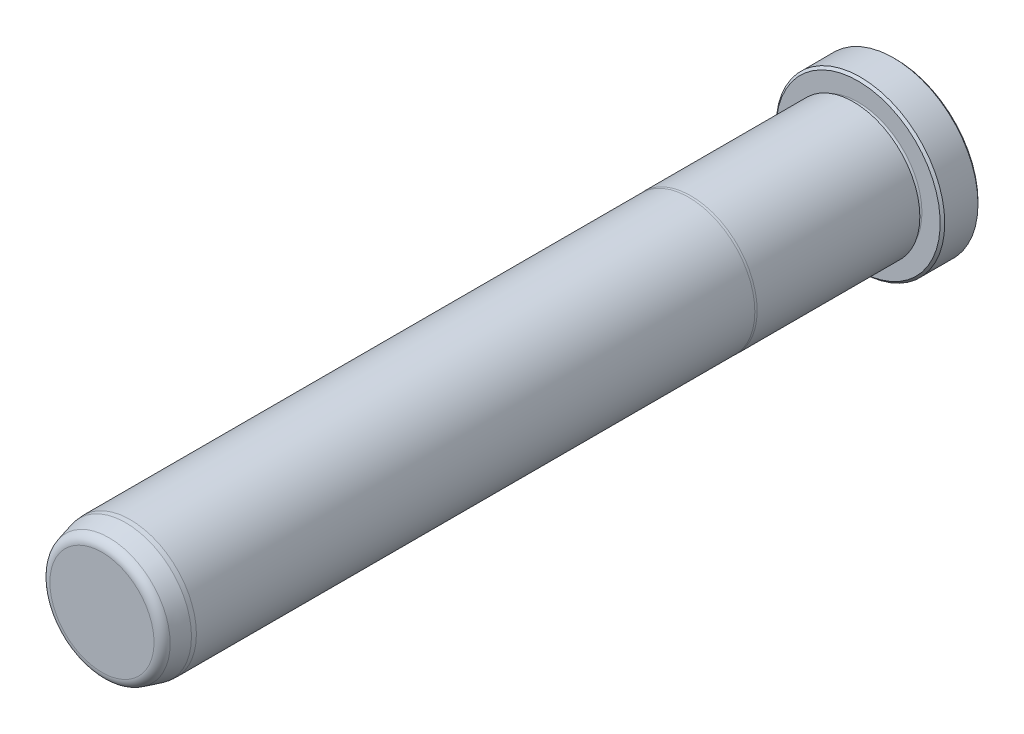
ISO-10303-21;
HEADER;
FILE_DESCRIPTION(('STEP AP214'),'2;1');
FILE_NAME('part.step','',(''),(''),'','','');
FILE_SCHEMA(('AUTOMOTIVE_DESIGN { 1 0 10303 214 1 1 1 1 }'));
ENDSEC;
DATA;
#1=APPLICATION_CONTEXT('core data for automotive mechanical design processes');
#2=APPLICATION_PROTOCOL_DEFINITION('international standard','automotive_design',2000,#1);
#3=PRODUCT_CONTEXT('',#1,'mechanical');
#4=PRODUCT('Part','Part','',(#3));
#5=PRODUCT_RELATED_PRODUCT_CATEGORY('part','',(#4));
#6=PRODUCT_DEFINITION_FORMATION('','',#4);
#7=PRODUCT_DEFINITION_CONTEXT('part definition',#1,'design');
#8=PRODUCT_DEFINITION('design','',#6,#7);
#9=PRODUCT_DEFINITION_SHAPE('','',#8);
#10=(LENGTH_UNIT() NAMED_UNIT(*) SI_UNIT(.MILLI.,.METRE.));
#11=(NAMED_UNIT(*) PLANE_ANGLE_UNIT() SI_UNIT($,.RADIAN.));
#12=(NAMED_UNIT(*) SI_UNIT($,.STERADIAN.) SOLID_ANGLE_UNIT());
#13=UNCERTAINTY_MEASURE_WITH_UNIT(LENGTH_MEASURE(1.E-05),#10,'distance_accuracy_value','');
#14=(GEOMETRIC_REPRESENTATION_CONTEXT(3) GLOBAL_UNCERTAINTY_ASSIGNED_CONTEXT((#13)) GLOBAL_UNIT_ASSIGNED_CONTEXT((#10,
#11,#12)) REPRESENTATION_CONTEXT('',''));
#15=CARTESIAN_POINT('',(0.,0.,0.));
#16=DIRECTION('',(0.,0.,1.));
#17=DIRECTION('',(1.,0.,0.));
#18=AXIS2_PLACEMENT_3D('',#15,#16,#17);
#19=CARTESIAN_POINT('',(0.,0.,0.));
#20=DIRECTION('',(0.,0.,1.));
#21=DIRECTION('',(1.,0.,0.));
#22=AXIS2_PLACEMENT_3D('',#19,#20,#21);
#23=PLANE('',#22);
#24=CARTESIAN_POINT('',(0.,0.,0.));
#25=DIRECTION('',(0.,0.,1.));
#26=DIRECTION('',(1.,0.,0.));
#27=AXIS2_PLACEMENT_3D('',#24,#25,#26);
#28=CIRCLE('',#27,13.7795);
#29=CARTESIAN_POINT('',(13.7795,0.,0.));
#30=VERTEX_POINT('',#29);
#31=EDGE_CURVE('E37',#30,#30,#28,.F.);
#32=ORIENTED_EDGE('',*,*,#31,.T.);
#33=EDGE_LOOP('',(#32));
#34=FACE_BOUND('',#33,.T.);
#35=ADVANCED_FACE('F30',(#34),#23,.F.);
#36=CARTESIAN_POINT('',(0.,0.,0.));
#37=DIRECTION('',(0.,0.,1.));
#38=DIRECTION('',(1.,0.,0.));
#39=AXIS2_PLACEMENT_3D('',#36,#37,#38);
#40=CYLINDRICAL_SURFACE('',#39,14.1605);
#41=CARTESIAN_POINT('',(0.,0.,0.380999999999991));
#42=DIRECTION('',(0.,0.,1.));
#43=DIRECTION('',(1.,0.,0.));
#44=AXIS2_PLACEMENT_3D('',#41,#42,#43);
#45=CIRCLE('',#44,14.1605);
#46=CARTESIAN_POINT('',(14.1605,0.,0.380999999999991));
#47=VERTEX_POINT('',#46);
#48=EDGE_CURVE('E41',#47,#47,#45,.T.);
#49=ORIENTED_EDGE('',*,*,#48,.T.);
#50=EDGE_LOOP('',(#49));
#51=FACE_BOUND('',#50,.T.);
#52=CARTESIAN_POINT('',(0.,0.,5.96900000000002));
#53=DIRECTION('',(0.,0.,-1.));
#54=DIRECTION('',(-1.,0.,0.));
#55=AXIS2_PLACEMENT_3D('',#52,#53,#54);
#56=CIRCLE('',#55,14.1605);
#57=CARTESIAN_POINT('',(-14.1605,0.,5.96900000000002));
#58=VERTEX_POINT('',#57);
#59=EDGE_CURVE('E45',#58,#58,#56,.T.);
#60=ORIENTED_EDGE('',*,*,#59,.T.);
#61=EDGE_LOOP('',(#60));
#62=FACE_BOUND('',#61,.T.);
#63=ADVANCED_FACE('F118',(#51,#62),#40,.T.);
#64=CARTESIAN_POINT('',(0.,14.1605,6.35));
#65=DIRECTION('',(0.,0.,-1.));
#66=DIRECTION('',(-1.,0.,0.));
#67=AXIS2_PLACEMENT_3D('',#64,#65,#66);
#68=PLANE('',#67);
#69=CARTESIAN_POINT('',(0.,0.,6.35));
#70=DIRECTION('',(0.,0.,-1.));
#71=DIRECTION('',(-1.,0.,0.));
#72=AXIS2_PLACEMENT_3D('',#69,#70,#71);
#73=CIRCLE('',#72,13.7795);
#74=CARTESIAN_POINT('',(-13.7795,0.,6.35));
#75=VERTEX_POINT('',#74);
#76=EDGE_CURVE('E10',#75,#75,#73,.F.);
#77=ORIENTED_EDGE('',*,*,#76,.T.);
#78=EDGE_LOOP('',(#77));
#79=FACE_BOUND('',#78,.T.);
#80=CARTESIAN_POINT('',(0.,0.,6.35));
#81=DIRECTION('',(0.,0.,1.));
#82=DIRECTION('',(1.,0.,0.));
#83=AXIS2_PLACEMENT_3D('',#80,#81,#82);
#84=CIRCLE('',#83,10.7188);
#85=CARTESIAN_POINT('',(10.7188,0.,6.35));
#86=VERTEX_POINT('',#85);
#87=EDGE_CURVE('E56',#86,#86,#84,.T.);
#88=ORIENTED_EDGE('',*,*,#87,.F.);
#89=EDGE_LOOP('',(#88));
#90=FACE_BOUND('',#89,.T.);
#91=ADVANCED_FACE('F113',(#79,#90),#68,.F.);
#92=CARTESIAN_POINT('',(0.,0.,6.731));
#93=DIRECTION('',(0.,0.,1.));
#94=DIRECTION('',(1.,0.,0.));
#95=AXIS2_PLACEMENT_3D('',#92,#93,#94);
#96=TOROIDAL_SURFACE('',#95,10.7188,0.381000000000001);
#97=CARTESIAN_POINT('',(0.,0.,7.112));
#98=DIRECTION('',(0.,0.,1.));
#99=DIRECTION('',(1.,0.,0.));
#100=AXIS2_PLACEMENT_3D('',#97,#98,#99);
#101=CIRCLE('',#100,10.7188);
#102=CARTESIAN_POINT('',(10.7188,0.,7.112));
#103=VERTEX_POINT('',#102);
#104=EDGE_CURVE('E59',#103,#103,#101,.T.);
#105=ORIENTED_EDGE('',*,*,#104,.F.);
#106=EDGE_LOOP('',(#105));
#107=FACE_BOUND('',#106,.T.);
#108=ORIENTED_EDGE('',*,*,#87,.T.);
#109=EDGE_LOOP('',(#108));
#110=FACE_BOUND('',#109,.T.);
#111=ADVANCED_FACE('F107',(#107,#110),#96,.F.);
#112=CARTESIAN_POINT('',(0.,10.7188,7.112));
#113=DIRECTION('',(0.,0.,1.));
#114=DIRECTION('',(1.,0.,0.));
#115=AXIS2_PLACEMENT_3D('',#112,#113,#114);
#116=PLANE('',#115);
#117=CARTESIAN_POINT('',(0.,0.,7.112));
#118=DIRECTION('',(0.,0.,1.));
#119=DIRECTION('',(1.,0.,0.));
#120=AXIS2_PLACEMENT_3D('',#117,#118,#119);
#121=CIRCLE('',#120,11.1252);
#122=CARTESIAN_POINT('',(11.1252,0.,7.112));
#123=VERTEX_POINT('',#122);
#124=EDGE_CURVE('E62',#123,#123,#121,.T.);
#125=ORIENTED_EDGE('',*,*,#124,.F.);
#126=EDGE_LOOP('',(#125));
#127=FACE_BOUND('',#126,.T.);
#128=ORIENTED_EDGE('',*,*,#104,.T.);
#129=EDGE_LOOP('',(#128));
#130=FACE_BOUND('',#129,.T.);
#131=ADVANCED_FACE('F101',(#127,#130),#116,.F.);
#132=CARTESIAN_POINT('',(0.,0.,0.));
#133=DIRECTION('',(0.,0.,1.));
#134=DIRECTION('',(1.,0.,0.));
#135=AXIS2_PLACEMENT_3D('',#132,#133,#134);
#136=CYLINDRICAL_SURFACE('',#135,11.1252);
#137=CARTESIAN_POINT('',(0.,0.,34.4347630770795));
#138=DIRECTION('',(0.,0.,1.));
#139=DIRECTION('',(1.,0.,0.));
#140=AXIS2_PLACEMENT_3D('',#137,#138,#139);
#141=CIRCLE('',#140,11.1252);
#142=CARTESIAN_POINT('',(11.1252,0.,34.4347630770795));
#143=VERTEX_POINT('',#142);
#144=EDGE_CURVE('E65',#143,#143,#141,.T.);
#145=ORIENTED_EDGE('',*,*,#144,.F.);
#146=EDGE_LOOP('',(#145));
#147=FACE_BOUND('',#146,.T.);
#148=ORIENTED_EDGE('',*,*,#124,.T.);
#149=EDGE_LOOP('',(#148));
#150=FACE_BOUND('',#149,.T.);
#151=ADVANCED_FACE('F95',(#147,#150),#136,.T.);
#152=CARTESIAN_POINT('',(0.,0.,34.4347630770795));
#153=DIRECTION('',(0.,0.,-1.));
#154=DIRECTION('',(-1.,0.,0.));
#155=AXIS2_PLACEMENT_3D('',#152,#153,#154);
#156=CONICAL_SURFACE('',#155,11.1252,0.0698131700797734);
#157=CARTESIAN_POINT('',(0.,0.,34.798));
#158=DIRECTION('',(0.,0.,1.));
#159=DIRECTION('',(1.,0.,0.));
#160=AXIS2_PLACEMENT_3D('',#157,#158,#159);
#161=CIRCLE('',#160,11.0998);
#162=CARTESIAN_POINT('',(11.0998,0.,34.798));
#163=VERTEX_POINT('',#162);
#164=EDGE_CURVE('E68',#163,#163,#161,.T.);
#165=ORIENTED_EDGE('',*,*,#164,.F.);
#166=EDGE_LOOP('',(#165));
#167=FACE_BOUND('',#166,.T.);
#168=ORIENTED_EDGE('',*,*,#144,.T.);
#169=EDGE_LOOP('',(#168));
#170=FACE_BOUND('',#169,.T.);
#171=ADVANCED_FACE('F89',(#167,#170),#156,.T.);
#172=CARTESIAN_POINT('',(0.,0.,0.));
#173=DIRECTION('',(0.,0.,1.));
#174=DIRECTION('',(1.,0.,0.));
#175=AXIS2_PLACEMENT_3D('',#172,#173,#174);
#176=CYLINDRICAL_SURFACE('',#175,11.0998);
#177=CARTESIAN_POINT('',(0.,0.,128.5875));
#178=DIRECTION('',(0.,0.,1.));
#179=DIRECTION('',(1.,0.,0.));
#180=AXIS2_PLACEMENT_3D('',#177,#178,#179);
#181=CIRCLE('',#180,11.0998);
#182=CARTESIAN_POINT('',(11.0998,0.,128.5875));
#183=VERTEX_POINT('',#182);
#184=EDGE_CURVE('E71',#183,#183,#181,.T.);
#185=ORIENTED_EDGE('',*,*,#184,.F.);
#186=EDGE_LOOP('',(#185));
#187=FACE_BOUND('',#186,.T.);
#188=ORIENTED_EDGE('',*,*,#164,.T.);
#189=EDGE_LOOP('',(#188));
#190=FACE_BOUND('',#189,.T.);
#191=ADVANCED_FACE('F83',(#187,#190),#176,.T.);
#192=CARTESIAN_POINT('',(0.,0.,128.5875));
#193=DIRECTION('',(0.,0.,-1.));
#194=DIRECTION('',(-1.,0.,0.));
#195=AXIS2_PLACEMENT_3D('',#192,#193,#194);
#196=CONICAL_SURFACE('',#195,11.0998,0.0872664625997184);
#197=CARTESIAN_POINT('',(0.,0.,129.3495));
#198=DIRECTION('',(0.,0.,1.));
#199=DIRECTION('',(1.,0.,0.));
#200=AXIS2_PLACEMENT_3D('',#197,#198,#199);
#201=CIRCLE('',#200,11.0331336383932);
#202=CARTESIAN_POINT('',(11.0331336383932,0.,129.3495));
#203=VERTEX_POINT('',#202);
#204=EDGE_CURVE('E74',#203,#203,#201,.T.);
#205=ORIENTED_EDGE('',*,*,#204,.F.);
#206=EDGE_LOOP('',(#205));
#207=FACE_BOUND('',#206,.T.);
#208=ORIENTED_EDGE('',*,*,#184,.T.);
#209=EDGE_LOOP('',(#208));
#210=FACE_BOUND('',#209,.T.);
#211=ADVANCED_FACE('F80',(#207,#210),#196,.T.);
#212=CARTESIAN_POINT('',(0.,0.,129.3495));
#213=DIRECTION('',(0.,0.,-1.));
#214=DIRECTION('',(-1.,0.,0.));
#215=AXIS2_PLACEMENT_3D('',#212,#213,#214);
#216=CONICAL_SURFACE('',#215,11.0331336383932,0.26179938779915);
#217=CARTESIAN_POINT('',(0.,0.,132.1733752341));
#218=DIRECTION('',(0.,0.,1.));
#219=DIRECTION('',(1.,0.,0.));
#220=AXIS2_PLACEMENT_3D('',#217,#218,#219);
#221=CIRCLE('',#220,10.2764785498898);
#222=CARTESIAN_POINT('',(10.2764785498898,0.,132.1733752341));
#223=VERTEX_POINT('',#222);
#224=EDGE_CURVE('E50',#223,#223,#221,.F.);
#225=ORIENTED_EDGE('',*,*,#224,.T.);
#226=EDGE_LOOP('',(#225));
#227=FACE_BOUND('',#226,.T.);
#228=ORIENTED_EDGE('',*,*,#204,.T.);
#229=EDGE_LOOP('',(#228));
#230=FACE_BOUND('',#229,.T.);
#231=ADVANCED_FACE('F78',(#227,#230),#216,.T.);
#232=CARTESIAN_POINT('',(0.,9.96120289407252,133.35));
#233=DIRECTION('',(0.,0.,-1.));
#234=DIRECTION('',(-1.,0.,0.));
#235=AXIS2_PLACEMENT_3D('',#232,#233,#234);
#236=PLANE('',#235);
#237=CARTESIAN_POINT('',(0.,0.,133.35));
#238=DIRECTION('',(0.,0.,-1.));
#239=DIRECTION('',(-1.,0.,0.));
#240=AXIS2_PLACEMENT_3D('',#237,#238,#239);
#241=CIRCLE('',#240,8.74307130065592);
#242=CARTESIAN_POINT('',(-8.74307130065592,0.,133.35));
#243=VERTEX_POINT('',#242);
#244=EDGE_CURVE('E53',#243,#243,#241,.F.);
#245=ORIENTED_EDGE('',*,*,#244,.T.);
#246=EDGE_LOOP('',(#245));
#247=FACE_BOUND('',#246,.T.);
#248=ADVANCED_FACE('F133',(#247),#236,.F.);
#249=CARTESIAN_POINT('',(0.,0.,131.7625));
#250=DIRECTION('',(0.,0.,-1.));
#251=DIRECTION('',(-1.,0.,0.));
#252=AXIS2_PLACEMENT_3D('',#249,#250,#251);
#253=TOROIDAL_SURFACE('',#252,8.74307130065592,1.5875);
#254=ORIENTED_EDGE('',*,*,#224,.F.);
#255=EDGE_LOOP('',(#254));
#256=FACE_BOUND('',#255,.T.);
#257=ORIENTED_EDGE('',*,*,#244,.F.);
#258=EDGE_LOOP('',(#257));
#259=FACE_BOUND('',#258,.T.);
#260=ADVANCED_FACE('F130',(#256,#259),#253,.T.);
#261=CARTESIAN_POINT('',(0.,0.,0.380999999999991));
#262=DIRECTION('',(0.,0.,1.));
#263=DIRECTION('',(1.,0.,0.));
#264=AXIS2_PLACEMENT_3D('',#261,#262,#263);
#265=CONICAL_SURFACE('',#264,14.1605,0.785398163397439);
#266=ORIENTED_EDGE('',*,*,#31,.F.);
#267=EDGE_LOOP('',(#266));
#268=FACE_BOUND('',#267,.T.);
#269=ORIENTED_EDGE('',*,*,#48,.F.);
#270=EDGE_LOOP('',(#269));
#271=FACE_BOUND('',#270,.T.);
#272=ADVANCED_FACE('F132',(#268,#271),#265,.T.);
#273=CARTESIAN_POINT('',(0.,0.,6.35));
#274=DIRECTION('',(0.,0.,-1.));
#275=DIRECTION('',(-1.,0.,0.));
#276=AXIS2_PLACEMENT_3D('',#273,#274,#275);
#277=CONICAL_SURFACE('',#276,13.7795,0.785398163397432);
#278=ORIENTED_EDGE('',*,*,#59,.F.);
#279=EDGE_LOOP('',(#278));
#280=FACE_BOUND('',#279,.T.);
#281=ORIENTED_EDGE('',*,*,#76,.F.);
#282=EDGE_LOOP('',(#281));
#283=FACE_BOUND('',#282,.T.);
#284=ADVANCED_FACE('F32',(#280,#283),#277,.T.);
#285=CLOSED_SHELL('',(#35,#63,#91,#111,#131,#151,#171,#191,#211,#231,#248,#260,#272,#284));
#286=MANIFOLD_SOLID_BREP('B2',#285);
#287=ADVANCED_BREP_SHAPE_REPRESENTATION('',(#18,#286),#14);
#288=SHAPE_DEFINITION_REPRESENTATION(#9,#287);
ENDSEC;
END-ISO-10303-21;
